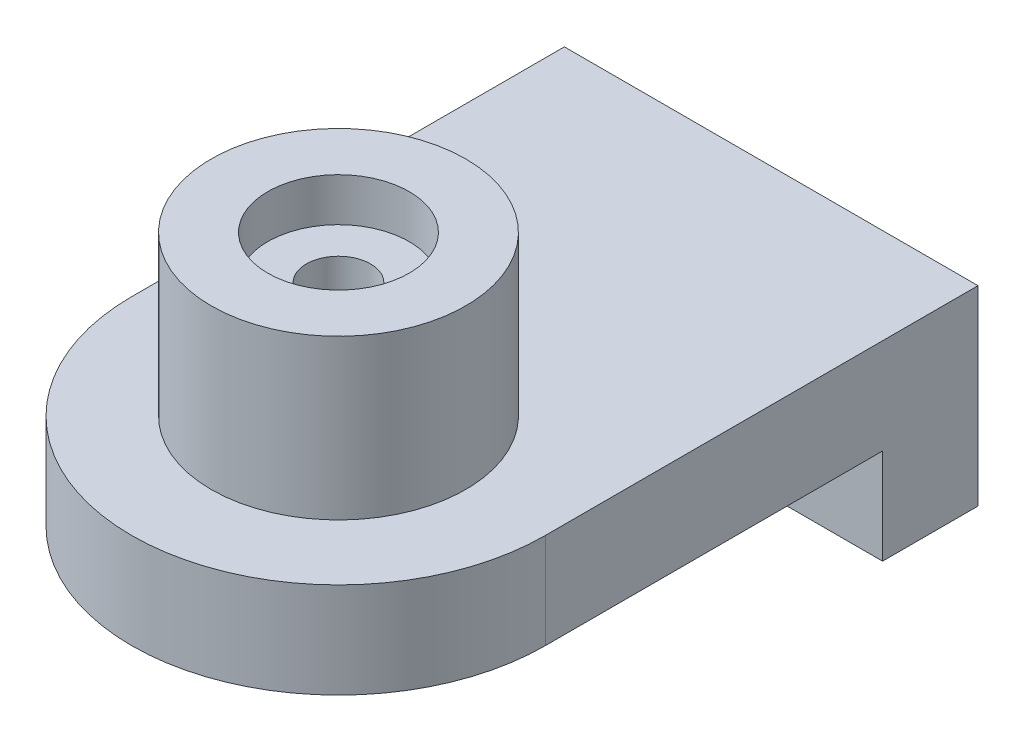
ISO-10303-21;
HEADER;
FILE_DESCRIPTION(('STEP AP214'),'2;1');
FILE_NAME('part.step','',(''),(''),'','','');
FILE_SCHEMA(('AUTOMOTIVE_DESIGN { 1 0 10303 214 1 1 1 1 }'));
ENDSEC;
DATA;
#1=APPLICATION_CONTEXT('core data for automotive mechanical design processes');
#2=APPLICATION_PROTOCOL_DEFINITION('international standard','automotive_design',2000,#1);
#3=PRODUCT_CONTEXT('',#1,'mechanical');
#4=PRODUCT('Part','Part','',(#3));
#5=PRODUCT_RELATED_PRODUCT_CATEGORY('part','',(#4));
#6=PRODUCT_DEFINITION_FORMATION('','',#4);
#7=PRODUCT_DEFINITION_CONTEXT('part definition',#1,'design');
#8=PRODUCT_DEFINITION('design','',#6,#7);
#9=PRODUCT_DEFINITION_SHAPE('','',#8);
#10=(LENGTH_UNIT() NAMED_UNIT(*) SI_UNIT(.MILLI.,.METRE.));
#11=(NAMED_UNIT(*) PLANE_ANGLE_UNIT() SI_UNIT($,.RADIAN.));
#12=(NAMED_UNIT(*) SI_UNIT($,.STERADIAN.) SOLID_ANGLE_UNIT());
#13=UNCERTAINTY_MEASURE_WITH_UNIT(LENGTH_MEASURE(1.E-05),#10,'distance_accuracy_value','');
#14=(GEOMETRIC_REPRESENTATION_CONTEXT(3) GLOBAL_UNCERTAINTY_ASSIGNED_CONTEXT((#13)) GLOBAL_UNIT_ASSIGNED_CONTEXT((#10,
#11,#12)) REPRESENTATION_CONTEXT('',''));
#15=CARTESIAN_POINT('',(0.,0.,0.));
#16=DIRECTION('',(0.,0.,1.));
#17=DIRECTION('',(1.,0.,0.));
#18=AXIS2_PLACEMENT_3D('',#15,#16,#17);
#19=CARTESIAN_POINT('',(0.,15.,0.));
#20=DIRECTION('',(0.,-1.,0.));
#21=DIRECTION('',(0.,0.,-1.));
#22=AXIS2_PLACEMENT_3D('',#19,#20,#21);
#23=PLANE('',#22);
#24=CARTESIAN_POINT('',(0.,15.,0.));
#25=DIRECTION('',(0.,1.,0.));
#26=DIRECTION('',(0.,0.,-1.));
#27=AXIS2_PLACEMENT_3D('',#24,#25,#26);
#28=CIRCLE('',#27,32.5);
#29=CARTESIAN_POINT('',(-32.5,15.,0.));
#30=VERTEX_POINT('',#29);
#31=CARTESIAN_POINT('',(32.5,15.,0.));
#32=VERTEX_POINT('',#31);
#33=EDGE_CURVE('E88',#30,#32,#28,.T.);
#34=ORIENTED_EDGE('',*,*,#33,.T.);
#35=DIRECTION('',(0.,0.,-1.));
#36=VECTOR('',#35,1.);
#37=CARTESIAN_POINT('',(32.5,15.,-68.));
#38=LINE('',#37,#36);
#39=CARTESIAN_POINT('',(32.5,15.,-68.));
#40=VERTEX_POINT('',#39);
#41=EDGE_CURVE('E142',#32,#40,#38,.T.);
#42=ORIENTED_EDGE('',*,*,#41,.T.);
#43=DIRECTION('',(-1.,0.,0.));
#44=VECTOR('',#43,1.);
#45=CARTESIAN_POINT('',(-32.5,15.,-68.));
#46=LINE('',#45,#44);
#47=CARTESIAN_POINT('',(-32.5,15.,-68.));
#48=VERTEX_POINT('',#47);
#49=EDGE_CURVE('E141',#40,#48,#46,.T.);
#50=ORIENTED_EDGE('',*,*,#49,.T.);
#51=DIRECTION('',(0.,0.,1.));
#52=VECTOR('',#51,1.);
#53=CARTESIAN_POINT('',(-32.5,15.,0.));
#54=LINE('',#53,#52);
#55=EDGE_CURVE('E52',#48,#30,#54,.T.);
#56=ORIENTED_EDGE('',*,*,#55,.T.);
#57=EDGE_LOOP('',(#34,#42,#50,#56));
#58=FACE_BOUND('',#57,.T.);
#59=CARTESIAN_POINT('',(0.,15.,0.));
#60=DIRECTION('',(0.,-1.,0.));
#61=DIRECTION('',(0.,0.,-1.));
#62=AXIS2_PLACEMENT_3D('',#59,#60,#61);
#63=CIRCLE('',#62,20.);
#64=CARTESIAN_POINT('',(0.,15.,-20.));
#65=VERTEX_POINT('',#64);
#66=EDGE_CURVE('E11',#65,#65,#63,.F.);
#67=ORIENTED_EDGE('',*,*,#66,.F.);
#68=EDGE_LOOP('',(#67));
#69=FACE_BOUND('',#68,.T.);
#70=ADVANCED_FACE('F28',(#58,#69),#23,.F.);
#71=CARTESIAN_POINT('',(0.,15.,0.));
#72=DIRECTION('',(0.,-1.,0.));
#73=DIRECTION('',(0.,0.,-1.));
#74=AXIS2_PLACEMENT_3D('',#71,#72,#73);
#75=CYLINDRICAL_SURFACE('',#74,32.5);
#76=CARTESIAN_POINT('',(0.,0.,0.));
#77=DIRECTION('',(0.,1.,0.));
#78=DIRECTION('',(0.,0.,-1.));
#79=AXIS2_PLACEMENT_3D('',#76,#77,#78);
#80=CIRCLE('',#79,32.5);
#81=CARTESIAN_POINT('',(-32.5,0.,0.));
#82=VERTEX_POINT('',#81);
#83=CARTESIAN_POINT('',(32.5,0.,0.));
#84=VERTEX_POINT('',#83);
#85=EDGE_CURVE('E84',#82,#84,#80,.T.);
#86=ORIENTED_EDGE('',*,*,#85,.T.);
#87=DIRECTION('',(0.,-1.,0.));
#88=VECTOR('',#87,1.);
#89=CARTESIAN_POINT('',(32.5,15.,0.));
#90=LINE('',#89,#88);
#91=EDGE_CURVE('E37',#32,#84,#90,.T.);
#92=ORIENTED_EDGE('',*,*,#91,.F.);
#93=ORIENTED_EDGE('',*,*,#33,.F.);
#94=DIRECTION('',(0.,-1.,0.));
#95=VECTOR('',#94,1.);
#96=CARTESIAN_POINT('',(-32.5,15.,0.));
#97=LINE('',#96,#95);
#98=EDGE_CURVE('E138',#30,#82,#97,.T.);
#99=ORIENTED_EDGE('',*,*,#98,.T.);
#100=EDGE_LOOP('',(#86,#92,#93,#99));
#101=FACE_BOUND('',#100,.T.);
#102=ADVANCED_FACE('F30',(#101),#75,.T.);
#103=CARTESIAN_POINT('',(32.5,15.,-68.));
#104=DIRECTION('',(-1.,0.,0.));
#105=DIRECTION('',(0.,0.,1.));
#106=AXIS2_PLACEMENT_3D('',#103,#104,#105);
#107=PLANE('',#106);
#108=DIRECTION('',(0.,0.,-1.));
#109=VECTOR('',#108,1.);
#110=CARTESIAN_POINT('',(32.5,0.,-68.));
#111=LINE('',#110,#109);
#112=CARTESIAN_POINT('',(32.5,0.,-53.));
#113=VERTEX_POINT('',#112);
#114=EDGE_CURVE('E89',#84,#113,#111,.T.);
#115=ORIENTED_EDGE('',*,*,#114,.T.);
#116=DIRECTION('',(0.,1.,0.));
#117=VECTOR('',#116,1.);
#118=CARTESIAN_POINT('',(32.5,-15.,-53.));
#119=LINE('',#118,#117);
#120=CARTESIAN_POINT('',(32.5,-15.,-53.));
#121=VERTEX_POINT('',#120);
#122=EDGE_CURVE('E99',#121,#113,#119,.T.);
#123=ORIENTED_EDGE('',*,*,#122,.F.);
#124=DIRECTION('',(0.,0.,1.));
#125=VECTOR('',#124,1.);
#126=CARTESIAN_POINT('',(32.5,-15.,-68.));
#127=LINE('',#126,#125);
#128=CARTESIAN_POINT('',(32.5,-15.,-68.));
#129=VERTEX_POINT('',#128);
#130=EDGE_CURVE('E108',#129,#121,#127,.T.);
#131=ORIENTED_EDGE('',*,*,#130,.F.);
#132=DIRECTION('',(0.,-1.,0.));
#133=VECTOR('',#132,1.);
#134=CARTESIAN_POINT('',(32.5,15.,-68.));
#135=LINE('',#134,#133);
#136=EDGE_CURVE('E134',#40,#129,#135,.T.);
#137=ORIENTED_EDGE('',*,*,#136,.F.);
#138=ORIENTED_EDGE('',*,*,#41,.F.);
#139=ORIENTED_EDGE('',*,*,#91,.T.);
#140=EDGE_LOOP('',(#115,#123,#131,#137,#138,#139));
#141=FACE_BOUND('',#140,.T.);
#142=ADVANCED_FACE('F149',(#141),#107,.F.);
#143=CARTESIAN_POINT('',(-32.5,15.,-68.));
#144=DIRECTION('',(0.,0.,1.));
#145=DIRECTION('',(1.,0.,0.));
#146=AXIS2_PLACEMENT_3D('',#143,#144,#145);
#147=PLANE('',#146);
#148=ORIENTED_EDGE('',*,*,#136,.T.);
#149=DIRECTION('',(1.,0.,0.));
#150=VECTOR('',#149,1.);
#151=CARTESIAN_POINT('',(-32.5,-15.,-68.));
#152=LINE('',#151,#150);
#153=CARTESIAN_POINT('',(-32.5,-15.,-68.));
#154=VERTEX_POINT('',#153);
#155=EDGE_CURVE('E122',#154,#129,#152,.T.);
#156=ORIENTED_EDGE('',*,*,#155,.F.);
#157=DIRECTION('',(0.,-1.,0.));
#158=VECTOR('',#157,1.);
#159=CARTESIAN_POINT('',(-32.5,15.,-68.));
#160=LINE('',#159,#158);
#161=EDGE_CURVE('E136',#48,#154,#160,.T.);
#162=ORIENTED_EDGE('',*,*,#161,.F.);
#163=ORIENTED_EDGE('',*,*,#49,.F.);
#164=EDGE_LOOP('',(#148,#156,#162,#163));
#165=FACE_BOUND('',#164,.T.);
#166=ADVANCED_FACE('F155',(#165),#147,.F.);
#167=CARTESIAN_POINT('',(-32.5,15.,0.));
#168=DIRECTION('',(1.,0.,0.));
#169=DIRECTION('',(0.,0.,-1.));
#170=AXIS2_PLACEMENT_3D('',#167,#168,#169);
#171=PLANE('',#170);
#172=ORIENTED_EDGE('',*,*,#161,.T.);
#173=DIRECTION('',(0.,0.,-1.));
#174=VECTOR('',#173,1.);
#175=CARTESIAN_POINT('',(-32.5,-15.,-68.));
#176=LINE('',#175,#174);
#177=CARTESIAN_POINT('',(-32.5,-15.,-53.));
#178=VERTEX_POINT('',#177);
#179=EDGE_CURVE('E100',#178,#154,#176,.T.);
#180=ORIENTED_EDGE('',*,*,#179,.F.);
#181=DIRECTION('',(0.,1.,0.));
#182=VECTOR('',#181,1.);
#183=CARTESIAN_POINT('',(-32.5,-15.,-53.));
#184=LINE('',#183,#182);
#185=CARTESIAN_POINT('',(-32.5,0.,-53.));
#186=VERTEX_POINT('',#185);
#187=EDGE_CURVE('E96',#178,#186,#184,.T.);
#188=ORIENTED_EDGE('',*,*,#187,.T.);
#189=DIRECTION('',(0.,0.,1.));
#190=VECTOR('',#189,1.);
#191=CARTESIAN_POINT('',(-32.5,0.,0.));
#192=LINE('',#191,#190);
#193=EDGE_CURVE('E81',#186,#82,#192,.T.);
#194=ORIENTED_EDGE('',*,*,#193,.T.);
#195=ORIENTED_EDGE('',*,*,#98,.F.);
#196=ORIENTED_EDGE('',*,*,#55,.F.);
#197=EDGE_LOOP('',(#172,#180,#188,#194,#195,#196));
#198=FACE_BOUND('',#197,.T.);
#199=ADVANCED_FACE('F103',(#198),#171,.F.);
#200=CARTESIAN_POINT('',(0.,0.,0.));
#201=DIRECTION('',(0.,-1.,0.));
#202=DIRECTION('',(0.,0.,-1.));
#203=AXIS2_PLACEMENT_3D('',#200,#201,#202);
#204=PLANE('',#203);
#205=CARTESIAN_POINT('',(0.,0.,0.));
#206=DIRECTION('',(0.,-1.,0.));
#207=DIRECTION('',(0.,0.,-1.));
#208=AXIS2_PLACEMENT_3D('',#205,#206,#207);
#209=CIRCLE('',#208,5.04189999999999);
#210=CARTESIAN_POINT('',(0.,0.,-5.04189999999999));
#211=VERTEX_POINT('',#210);
#212=EDGE_CURVE('E32',#211,#211,#209,.T.);
#213=ORIENTED_EDGE('',*,*,#212,.F.);
#214=EDGE_LOOP('',(#213));
#215=FACE_BOUND('',#214,.T.);
#216=DIRECTION('',(-1.,0.,0.));
#217=VECTOR('',#216,1.);
#218=CARTESIAN_POINT('',(-32.5,0.,-53.));
#219=LINE('',#218,#217);
#220=EDGE_CURVE('E44',#113,#186,#219,.T.);
#221=ORIENTED_EDGE('',*,*,#220,.F.);
#222=ORIENTED_EDGE('',*,*,#114,.F.);
#223=ORIENTED_EDGE('',*,*,#85,.F.);
#224=ORIENTED_EDGE('',*,*,#193,.F.);
#225=EDGE_LOOP('',(#221,#222,#223,#224));
#226=FACE_BOUND('',#225,.T.);
#227=ADVANCED_FACE('F82',(#215,#226),#204,.T.);
#228=CARTESIAN_POINT('',(-32.5,-15.,-53.));
#229=DIRECTION('',(0.,0.,-1.));
#230=DIRECTION('',(-1.,0.,0.));
#231=AXIS2_PLACEMENT_3D('',#228,#229,#230);
#232=PLANE('',#231);
#233=ORIENTED_EDGE('',*,*,#220,.T.);
#234=ORIENTED_EDGE('',*,*,#187,.F.);
#235=DIRECTION('',(-1.,0.,0.));
#236=VECTOR('',#235,1.);
#237=CARTESIAN_POINT('',(-32.5,-15.,-53.));
#238=LINE('',#237,#236);
#239=EDGE_CURVE('E105',#121,#178,#238,.T.);
#240=ORIENTED_EDGE('',*,*,#239,.F.);
#241=ORIENTED_EDGE('',*,*,#122,.T.);
#242=EDGE_LOOP('',(#233,#234,#240,#241));
#243=FACE_BOUND('',#242,.T.);
#244=ADVANCED_FACE('F94',(#243),#232,.F.);
#245=CARTESIAN_POINT('',(-32.5,-15.,-53.));
#246=DIRECTION('',(0.,1.,0.));
#247=DIRECTION('',(0.,0.,1.));
#248=AXIS2_PLACEMENT_3D('',#245,#246,#247);
#249=PLANE('',#248);
#250=ORIENTED_EDGE('',*,*,#179,.T.);
#251=ORIENTED_EDGE('',*,*,#155,.T.);
#252=ORIENTED_EDGE('',*,*,#130,.T.);
#253=ORIENTED_EDGE('',*,*,#239,.T.);
#254=EDGE_LOOP('',(#250,#251,#252,#253));
#255=FACE_BOUND('',#254,.T.);
#256=ADVANCED_FACE('F157',(#255),#249,.F.);
#257=CARTESIAN_POINT('',(0.,40.,0.));
#258=DIRECTION('',(0.,-1.,0.));
#259=DIRECTION('',(0.,0.,-1.));
#260=AXIS2_PLACEMENT_3D('',#257,#258,#259);
#261=CYLINDRICAL_SURFACE('',#260,20.);
#262=CARTESIAN_POINT('',(0.,40.,0.));
#263=DIRECTION('',(0.,1.,0.));
#264=DIRECTION('',(0.,0.,1.));
#265=AXIS2_PLACEMENT_3D('',#262,#263,#264);
#266=CIRCLE('',#265,20.);
#267=CARTESIAN_POINT('',(0.,40.,20.));
#268=VERTEX_POINT('',#267);
#269=EDGE_CURVE('E101',#268,#268,#266,.T.);
#270=ORIENTED_EDGE('',*,*,#269,.F.);
#271=EDGE_LOOP('',(#270));
#272=FACE_BOUND('',#271,.T.);
#273=ORIENTED_EDGE('',*,*,#66,.T.);
#274=EDGE_LOOP('',(#273));
#275=FACE_BOUND('',#274,.T.);
#276=ADVANCED_FACE('F159',(#272,#275),#261,.T.);
#277=CARTESIAN_POINT('',(0.,40.,0.));
#278=DIRECTION('',(0.,1.,0.));
#279=DIRECTION('',(0.,0.,1.));
#280=AXIS2_PLACEMENT_3D('',#277,#278,#279);
#281=PLANE('',#280);
#282=CARTESIAN_POINT('',(0.,40.,0.));
#283=DIRECTION('',(0.,1.,0.));
#284=DIRECTION('',(0.,0.,1.));
#285=AXIS2_PLACEMENT_3D('',#282,#283,#284);
#286=CIRCLE('',#285,11.1125);
#287=CARTESIAN_POINT('',(0.,40.,11.1125));
#288=VERTEX_POINT('',#287);
#289=EDGE_CURVE('E251',#288,#288,#286,.T.);
#290=ORIENTED_EDGE('',*,*,#289,.F.);
#291=EDGE_LOOP('',(#290));
#292=FACE_BOUND('',#291,.T.);
#293=ORIENTED_EDGE('',*,*,#269,.T.);
#294=EDGE_LOOP('',(#293));
#295=FACE_BOUND('',#294,.T.);
#296=ADVANCED_FACE('F166',(#292,#295),#281,.T.);
#297=CARTESIAN_POINT('',(0.,40.,0.));
#298=DIRECTION('',(0.,1.,0.));
#299=DIRECTION('',(0.,0.,1.));
#300=AXIS2_PLACEMENT_3D('',#297,#298,#299);
#301=CYLINDRICAL_SURFACE('',#300,11.1125);
#302=CARTESIAN_POINT('',(0.,33.1928,0.));
#303=DIRECTION('',(0.,1.,0.));
#304=DIRECTION('',(0.,0.,1.));
#305=AXIS2_PLACEMENT_3D('',#302,#303,#304);
#306=CIRCLE('',#305,11.1125);
#307=CARTESIAN_POINT('',(0.,33.1928,11.1125));
#308=VERTEX_POINT('',#307);
#309=EDGE_CURVE('E248',#308,#308,#306,.T.);
#310=ORIENTED_EDGE('',*,*,#309,.F.);
#311=EDGE_LOOP('',(#310));
#312=FACE_BOUND('',#311,.T.);
#313=ORIENTED_EDGE('',*,*,#289,.T.);
#314=EDGE_LOOP('',(#313));
#315=FACE_BOUND('',#314,.T.);
#316=ADVANCED_FACE('F216',(#312,#315),#301,.F.);
#317=CARTESIAN_POINT('',(5.0419,33.1928,0.));
#318=DIRECTION('',(0.,-1.,0.));
#319=DIRECTION('',(0.,0.,-1.));
#320=AXIS2_PLACEMENT_3D('',#317,#318,#319);
#321=PLANE('',#320);
#322=CARTESIAN_POINT('',(0.,33.1928,0.));
#323=DIRECTION('',(0.,1.,0.));
#324=DIRECTION('',(0.,0.,1.));
#325=AXIS2_PLACEMENT_3D('',#322,#323,#324);
#326=CIRCLE('',#325,5.0419);
#327=CARTESIAN_POINT('',(0.,33.1928,5.0419));
#328=VERTEX_POINT('',#327);
#329=EDGE_CURVE('E247',#328,#328,#326,.T.);
#330=ORIENTED_EDGE('',*,*,#329,.F.);
#331=EDGE_LOOP('',(#330));
#332=FACE_BOUND('',#331,.T.);
#333=ORIENTED_EDGE('',*,*,#309,.T.);
#334=EDGE_LOOP('',(#333));
#335=FACE_BOUND('',#334,.T.);
#336=ADVANCED_FACE('F224',(#332,#335),#321,.F.);
#337=CARTESIAN_POINT('',(0.,40.,0.));
#338=DIRECTION('',(0.,1.,0.));
#339=DIRECTION('',(0.,0.,1.));
#340=AXIS2_PLACEMENT_3D('',#337,#338,#339);
#341=CYLINDRICAL_SURFACE('',#340,5.04189999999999);
#342=ORIENTED_EDGE('',*,*,#212,.T.);
#343=EDGE_LOOP('',(#342));
#344=FACE_BOUND('',#343,.T.);
#345=ORIENTED_EDGE('',*,*,#329,.T.);
#346=EDGE_LOOP('',(#345));
#347=FACE_BOUND('',#346,.T.);
#348=ADVANCED_FACE('F232',(#344,#347),#341,.F.);
#349=CLOSED_SHELL('',(#70,#102,#142,#166,#199,#227,#244,#256,#276,#296,#316,#336,#348));
#350=MANIFOLD_SOLID_BREP('B2',#349);
#351=ADVANCED_BREP_SHAPE_REPRESENTATION('',(#18,#350),#14);
#352=SHAPE_DEFINITION_REPRESENTATION(#9,#351);
ENDSEC;
END-ISO-10303-21;
